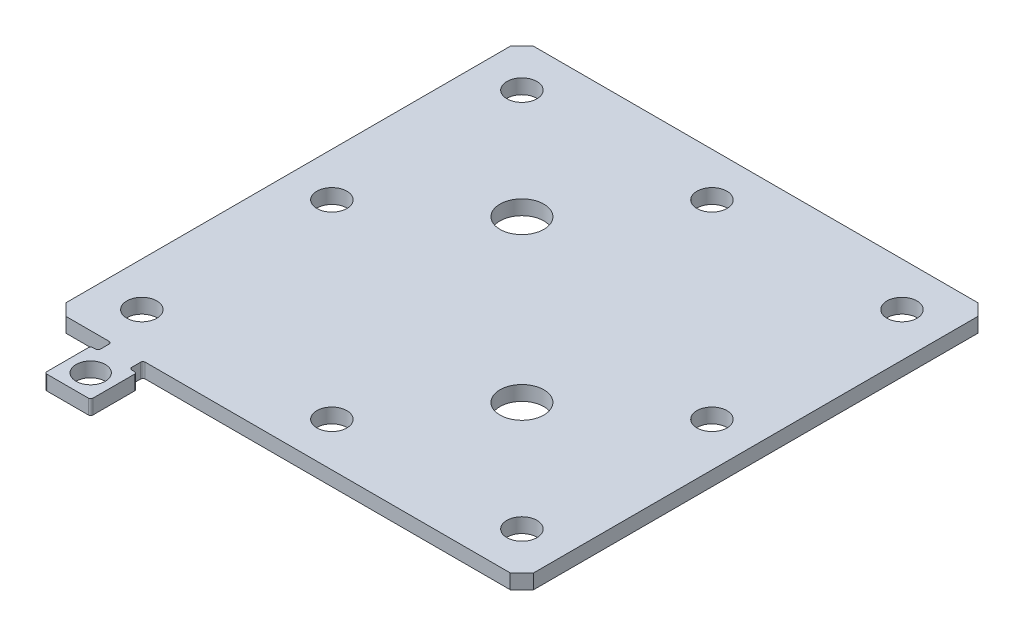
from build123d import *

# Parameters (mm, degrees)
SKETCH1_R           = 3.2639
BOSS_EXTRUDE1_DEPTH = 3.175
FILLET1_R           = 0.5
SKETCH2_R           = 3.175
SKETCH2_R_2         = 4.7625
CUT_EXTRUDE2_DEPTH  = 82.473297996


with BuildPart() as part:
    # Sketch1 → Boss-Extrude1 (new body)
    with BuildSketch(Plane(origin=(0, 0, 0), x_dir=(1, 0, 0), z_dir=(0, 1, 0))):
        Polygon((-51.423629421, 48.883629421), (-48.883629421, 51.423629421), (47.636370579, 51.423629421), (50.176370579, 48.883629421), (50.176370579, -47.636370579), (47.636370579, -50.176370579), (-32.136129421, -50.176370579), (-32.136129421, -53.11440405), (-30.548629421, -53.11440405), (-30.548629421, -63.11440405), (-40.548629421, -63.11440405), (-40.548629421, -53.11440405), (-38.961129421, -53.11440405), (-38.961129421, -50.176370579), (-48.883629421, -50.176370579), (-51.423629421, -47.636370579), align=None)
        with Locations(Location((-41.898629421, 41.898629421, 0), (0, 0, 270))):
            Circle(SKETCH1_R, mode=Mode.SUBTRACT)
        with Locations(Location((-0.623629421, 41.898629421, 0), (0, 0, 270))):
            Circle(SKETCH1_R, mode=Mode.SUBTRACT)
        with Locations(Location((40.651370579, 41.898629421, 0), (0, 0, 270))):
            Circle(SKETCH1_R, mode=Mode.SUBTRACT)
        with Locations(Location((40.651370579, 0.623629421, 0), (0, 0, 270))):
            Circle(SKETCH1_R, mode=Mode.SUBTRACT)
        with Locations(Location((40.651370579, -40.651370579, 0), (0, 0, 270))):
            Circle(SKETCH1_R, mode=Mode.SUBTRACT)
        with Locations(Location((-0.623629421, -40.651370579, 0), (0, 0, 270))):
            Circle(SKETCH1_R, mode=Mode.SUBTRACT)
        with Locations(Location((-41.898629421, -40.651370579, 0), (0, 0, 270))):
            Circle(SKETCH1_R, mode=Mode.SUBTRACT)
        with Locations(Location((-41.898629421, 0.623629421, 0), (0, 0, 270))):
            Circle(SKETCH1_R, mode=Mode.SUBTRACT)
    extrude(amount=BOSS_EXTRUDE1_DEPTH)

    # Fillet1
    fillet1_edges = [part.edges().sort_by_distance(p)[0] for p in [
        (-32.136129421, 1.5875, 53.11440405),
        (-30.548629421, 1.5875, 53.11440405),
        (-30.548629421, 1.5875, 63.11440405),
        (-40.548629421, 1.5875, 63.11440405),
        (-40.548629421, 1.5875, 53.11440405),
        (-38.961129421, 1.5875, 53.11440405),
        (-38.961129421, 1.5875, 50.176370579),
        (-32.136129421, 1.5875, 50.176370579),
    ]]
    fillet(fillet1_edges, radius=FILLET1_R)

    # Sketch2 → Cut-Extrude2 (cut, through all)
    with BuildSketch(Plane(origin=(0, 3.175, 0), x_dir=(1, 0, 0), z_dir=(0, 1, 0))):
        with Locations(Location((-35.548629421, -58.11440405, 0), (0, 0, 270))):
            Circle(SKETCH2_R)
        with Locations(Location((-18.086129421, 18.086129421, 0), (0, 0, 270))):
            Circle(SKETCH2_R_2)
        with Locations(Location((16.838870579, -16.838870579, 0), (0, 0, 270))):
            Circle(SKETCH2_R_2)
    extrude(amount=-CUT_EXTRUDE2_DEPTH, mode=Mode.SUBTRACT)


solid = part.part
